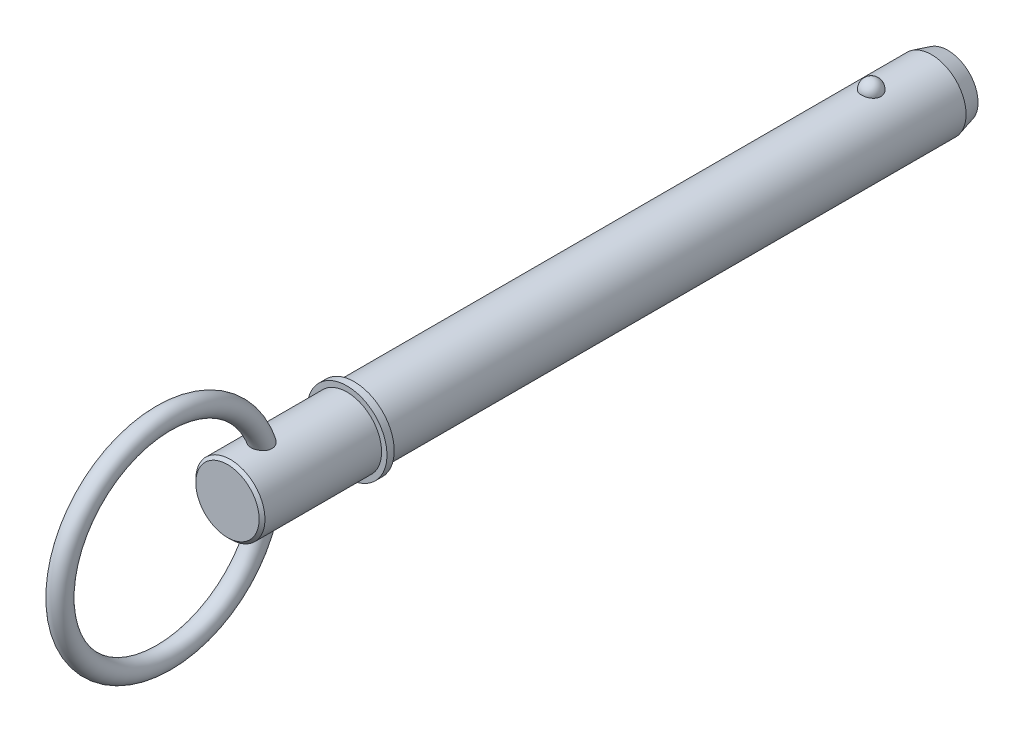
from build123d import *

# Parameters (mm, degrees)
SKETCH2_R           = 9.525
BOSS_EXTRUDE1_DEPTH = 139.7
BOSS_EXTRUDE2_START = 23.8
SKETCH3_R           = 9.525
BOSS_EXTRUDE2_DEPTH = 23.8
CHAMFER1_SIZE       = 4.5
CHAMFER1_SIZE2      = 1.205771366
SKETCH20_W          = 2
SKETCH20_H          = 11
SKETCH21_R          = 9.525
BOSS_EXTRUDE3_DEPTH = 34.93
CHAMFER2_SIZE       = 0.8
SKETCH24_R          = 2.75


with BuildPart() as part:
    # Sketch2 → Boss-Extrude1 (new body)
    with BuildSketch(Plane.XY):
        Circle(SKETCH2_R)
    extrude(amount=BOSS_EXTRUDE1_DEPTH)

    # Sketch3 → Boss-Extrude2 (add)
    with BuildSketch(Plane(origin=(0, 0, 0), x_dir=(-1, 0, 0), z_dir=(0, 0, -1)).offset(BOSS_EXTRUDE2_START)):
        Circle(SKETCH3_R)
    extrude(amount=-BOSS_EXTRUDE2_DEPTH)

    # Chamfer1
    chamfer1_edges = [part.edges().sort_by_distance(p)[0] for p in [
        (9.525, 0, -23.8),
    ]]
    chamfer1_side = [part.faces().sort_by_distance(p)[0] for p in [
        (9.525, 0, -11.9),
    ]]
    chamfer(chamfer1_edges, length=CHAMFER1_SIZE, length2=CHAMFER1_SIZE2, reference=chamfer1_side[0])

    # Sketch18 → Revolve1 (revolve)
    with BuildSketch(Plane(origin=(0, 0, 0), x_dir=(0, 0, -1), z_dir=(1, 0, 0))):
        with BuildLine():
            Line((2.69, 12.215), (2.69, 6.835))
            ThreePointArc((2.69, 6.835), (0, 9.525), (2.69, 12.215))
        make_face()
    revolve(axis=Axis((0, 12.215, -2.69), (0, -1, 0)))

    # Sketch20 → Revolve2 (revolve)
    with BuildSketch(Plane(origin=(0, 0, 0), x_dir=(0, 0, -1), z_dir=(1, 0, 0)), mode=Mode.PRIVATE) as revolve2_sk:
        with Locations((-140.7, 5.5)):
            Rectangle(SKETCH20_W, SKETCH20_H)
    revolve(revolve2_sk.sketch.rotate(Axis((0, 0, 33.728787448), (0, 0, 1)), 90), axis=Axis((0, 0, 33.728787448), (0, 0, 1)))

    # Sketch21 → Boss-Extrude3 (add)
    with BuildSketch(Plane(origin=(0, 0, 139.7), x_dir=(-1, 0, 0), z_dir=(0, 0, -1))):
        Circle(SKETCH21_R)
    extrude(amount=-BOSS_EXTRUDE3_DEPTH)

    # Chamfer2
    chamfer2_edges = [part.edges().sort_by_distance(p)[0] for p in [
        (9.525, 0, 174.63),
    ]]
    chamfer(chamfer2_edges, length=CHAMFER2_SIZE)

    # Sweep1: sweep along a path in Sketch23
    with BuildLine(Plane(origin=(0, 0, 0), x_dir=(0, 0, -1), z_dir=(1, 0, 0))) as sweep1_path:
        CenterArc((-192.205, 0), 28.575, 0, 360)
    # Sketch24 → Sweep1 (sweep)
    with BuildSketch(Plane(origin=(0, 0, 0), x_dir=(1, 0, 0), z_dir=(0, 1, 0))):
        with Locations((0, -163.63)):
            Circle(SKETCH24_R)
    sweep(path=sweep1_path.line)


solid = part.part
